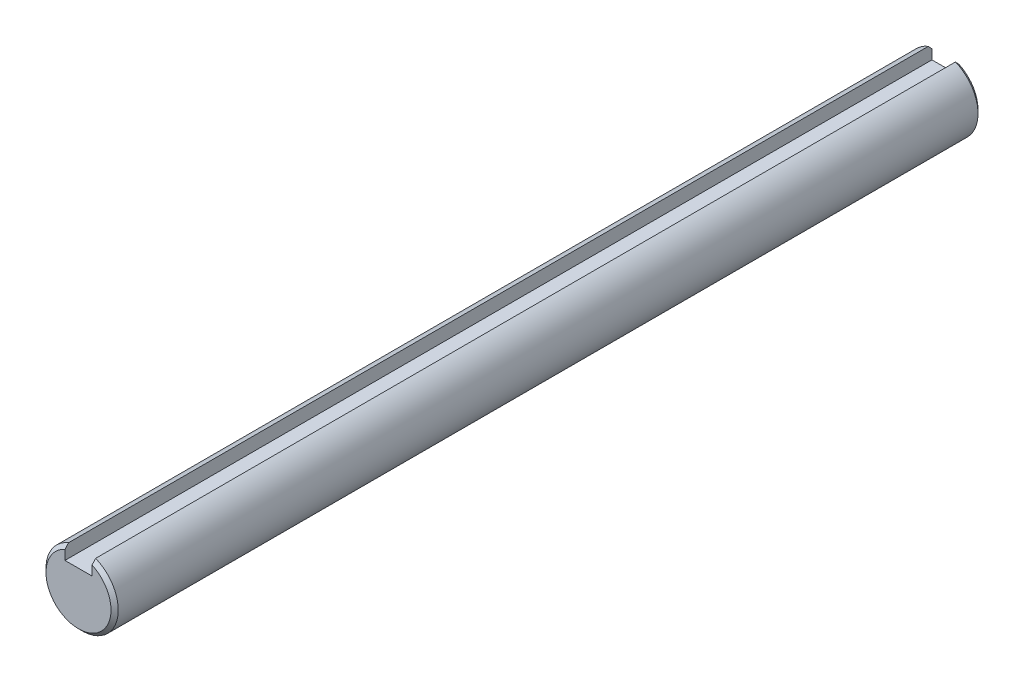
ISO-10303-21;
HEADER;
FILE_DESCRIPTION(('STEP AP214'),'2;1');
FILE_NAME('part.step','',(''),(''),'','','');
FILE_SCHEMA(('AUTOMOTIVE_DESIGN { 1 0 10303 214 1 1 1 1 }'));
ENDSEC;
DATA;
#1=APPLICATION_CONTEXT('core data for automotive mechanical design processes');
#2=APPLICATION_PROTOCOL_DEFINITION('international standard','automotive_design',2000,#1);
#3=PRODUCT_CONTEXT('',#1,'mechanical');
#4=PRODUCT('Part','Part','',(#3));
#5=PRODUCT_RELATED_PRODUCT_CATEGORY('part','',(#4));
#6=PRODUCT_DEFINITION_FORMATION('','',#4);
#7=PRODUCT_DEFINITION_CONTEXT('part definition',#1,'design');
#8=PRODUCT_DEFINITION('design','',#6,#7);
#9=PRODUCT_DEFINITION_SHAPE('','',#8);
#10=(LENGTH_UNIT() NAMED_UNIT(*) SI_UNIT(.MILLI.,.METRE.));
#11=(NAMED_UNIT(*) PLANE_ANGLE_UNIT() SI_UNIT($,.RADIAN.));
#12=(NAMED_UNIT(*) SI_UNIT($,.STERADIAN.) SOLID_ANGLE_UNIT());
#13=UNCERTAINTY_MEASURE_WITH_UNIT(LENGTH_MEASURE(1.E-05),#10,'distance_accuracy_value','');
#14=(GEOMETRIC_REPRESENTATION_CONTEXT(3) GLOBAL_UNCERTAINTY_ASSIGNED_CONTEXT((#13)) GLOBAL_UNIT_ASSIGNED_CONTEXT((#10,
#11,#12)) REPRESENTATION_CONTEXT('',''));
#15=CARTESIAN_POINT('',(0.,0.,0.));
#16=DIRECTION('',(0.,0.,1.));
#17=DIRECTION('',(1.,0.,0.));
#18=AXIS2_PLACEMENT_3D('',#15,#16,#17);
#19=CARTESIAN_POINT('',(0.,0.,38.1));
#20=DIRECTION('',(0.,0.,-1.));
#21=DIRECTION('',(-1.,0.,0.));
#22=AXIS2_PLACEMENT_3D('',#19,#20,#21);
#23=CYLINDRICAL_SURFACE('',#22,3.175);
#24=DIRECTION('',(0.,0.,-1.));
#25=VECTOR('',#24,1.);
#26=CARTESIAN_POINT('',(-1.190625,2.94330377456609,38.1));
#27=LINE('',#26,#25);
#28=CARTESIAN_POINT('',(-1.190625,2.94330377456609,37.7825));
#29=VERTEX_POINT('',#28);
#30=CARTESIAN_POINT('',(-1.190625,2.94330377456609,-37.7824999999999));
#31=VERTEX_POINT('',#30);
#32=EDGE_CURVE('E115',#29,#31,#27,.T.);
#33=ORIENTED_EDGE('',*,*,#32,.T.);
#34=CARTESIAN_POINT('',(0.,0.,-37.7824999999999));
#35=DIRECTION('',(0.,0.,1.));
#36=DIRECTION('',(1.,0.,0.));
#37=AXIS2_PLACEMENT_3D('',#34,#35,#36);
#38=CIRCLE('',#37,3.175);
#39=CARTESIAN_POINT('',(1.190625,2.94330377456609,-37.7824999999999));
#40=VERTEX_POINT('',#39);
#41=EDGE_CURVE('E126',#31,#40,#38,.T.);
#42=ORIENTED_EDGE('',*,*,#41,.T.);
#43=DIRECTION('',(0.,0.,-1.));
#44=VECTOR('',#43,1.);
#45=CARTESIAN_POINT('',(1.190625,2.94330377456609,38.1));
#46=LINE('',#45,#44);
#47=CARTESIAN_POINT('',(1.190625,2.94330377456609,37.7825));
#48=VERTEX_POINT('',#47);
#49=EDGE_CURVE('E119',#40,#48,#46,.F.);
#50=ORIENTED_EDGE('',*,*,#49,.T.);
#51=CARTESIAN_POINT('',(0.,0.,37.7825));
#52=DIRECTION('',(0.,0.,1.));
#53=DIRECTION('',(1.,0.,0.));
#54=AXIS2_PLACEMENT_3D('',#51,#52,#53);
#55=CIRCLE('',#54,3.175);
#56=EDGE_CURVE('E124',#48,#29,#55,.F.);
#57=ORIENTED_EDGE('',*,*,#56,.T.);
#58=EDGE_LOOP('',(#33,#42,#50,#57));
#59=FACE_BOUND('',#58,.T.);
#60=ADVANCED_FACE('F34',(#59),#23,.T.);
#61=CARTESIAN_POINT('',(0.,0.,38.1));
#62=DIRECTION('',(0.,0.,1.));
#63=DIRECTION('',(1.,0.,0.));
#64=AXIS2_PLACEMENT_3D('',#61,#62,#63);
#65=PLANE('',#64);
#66=DIRECTION('',(0.,-1.,0.));
#67=VECTOR('',#66,1.);
#68=CARTESIAN_POINT('',(-1.190625,3.175,38.1));
#69=LINE('',#68,#67);
#70=CARTESIAN_POINT('',(-1.190625,2.59763707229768,38.1));
#71=VERTEX_POINT('',#70);
#72=CARTESIAN_POINT('',(-1.190625,1.75267877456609,38.1));
#73=VERTEX_POINT('',#72);
#74=EDGE_CURVE('E88',#71,#73,#69,.T.);
#75=ORIENTED_EDGE('',*,*,#74,.F.);
#76=CARTESIAN_POINT('',(0.,0.,38.1));
#77=DIRECTION('',(0.,0.,1.));
#78=DIRECTION('',(1.,0.,0.));
#79=AXIS2_PLACEMENT_3D('',#76,#77,#78);
#80=CIRCLE('',#79,2.85750000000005);
#81=CARTESIAN_POINT('',(1.190625,2.59763707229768,38.1));
#82=VERTEX_POINT('',#81);
#83=EDGE_CURVE('E11',#71,#82,#80,.T.);
#84=ORIENTED_EDGE('',*,*,#83,.T.);
#85=DIRECTION('',(0.,1.,0.));
#86=VECTOR('',#85,1.);
#87=CARTESIAN_POINT('',(1.190625,3.175,38.1));
#88=LINE('',#87,#86);
#89=CARTESIAN_POINT('',(1.190625,1.75267877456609,38.1));
#90=VERTEX_POINT('',#89);
#91=EDGE_CURVE('E109',#90,#82,#88,.T.);
#92=ORIENTED_EDGE('',*,*,#91,.F.);
#93=DIRECTION('',(1.,0.,0.));
#94=VECTOR('',#93,1.);
#95=CARTESIAN_POINT('',(-1.190625,1.75267877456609,38.1));
#96=LINE('',#95,#94);
#97=EDGE_CURVE('E95',#73,#90,#96,.T.);
#98=ORIENTED_EDGE('',*,*,#97,.F.);
#99=EDGE_LOOP('',(#75,#84,#92,#98));
#100=FACE_BOUND('',#99,.T.);
#101=ADVANCED_FACE('F107',(#100),#65,.T.);
#102=CARTESIAN_POINT('',(0.,0.,-38.1));
#103=DIRECTION('',(0.,0.,1.));
#104=DIRECTION('',(1.,0.,0.));
#105=AXIS2_PLACEMENT_3D('',#102,#103,#104);
#106=PLANE('',#105);
#107=DIRECTION('',(0.,1.,0.));
#108=VECTOR('',#107,1.);
#109=CARTESIAN_POINT('',(1.190625,3.175,-38.1));
#110=LINE('',#109,#108);
#111=CARTESIAN_POINT('',(1.190625,1.75267877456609,-38.1));
#112=VERTEX_POINT('',#111);
#113=CARTESIAN_POINT('',(1.190625,2.59763707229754,-38.1));
#114=VERTEX_POINT('',#113);
#115=EDGE_CURVE('E105',#112,#114,#110,.T.);
#116=ORIENTED_EDGE('',*,*,#115,.T.);
#117=CARTESIAN_POINT('',(0.,0.,-38.1));
#118=DIRECTION('',(0.,0.,1.));
#119=DIRECTION('',(1.,0.,0.));
#120=AXIS2_PLACEMENT_3D('',#117,#118,#119);
#121=CIRCLE('',#120,2.85749999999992);
#122=CARTESIAN_POINT('',(-1.190625,2.59763707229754,-38.1));
#123=VERTEX_POINT('',#122);
#124=EDGE_CURVE('E58',#114,#123,#121,.F.);
#125=ORIENTED_EDGE('',*,*,#124,.T.);
#126=DIRECTION('',(0.,-1.,0.));
#127=VECTOR('',#126,1.);
#128=CARTESIAN_POINT('',(-1.190625,0.,-38.1));
#129=LINE('',#128,#127);
#130=CARTESIAN_POINT('',(-1.190625,1.75267877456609,-38.1));
#131=VERTEX_POINT('',#130);
#132=EDGE_CURVE('E122',#123,#131,#129,.T.);
#133=ORIENTED_EDGE('',*,*,#132,.T.);
#134=DIRECTION('',(1.,0.,0.));
#135=VECTOR('',#134,1.);
#136=CARTESIAN_POINT('',(-1.190625,1.75267877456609,-38.1));
#137=LINE('',#136,#135);
#138=EDGE_CURVE('E103',#131,#112,#137,.T.);
#139=ORIENTED_EDGE('',*,*,#138,.T.);
#140=EDGE_LOOP('',(#116,#125,#133,#139));
#141=FACE_BOUND('',#140,.T.);
#142=ADVANCED_FACE('F146',(#141),#106,.F.);
#143=CARTESIAN_POINT('',(1.190625,3.175,-38.1));
#144=DIRECTION('',(1.,0.,0.));
#145=DIRECTION('',(0.,0.,-1.));
#146=AXIS2_PLACEMENT_3D('',#143,#144,#145);
#147=PLANE('',#146);
#148=ORIENTED_EDGE('',*,*,#49,.F.);
#149=CARTESIAN_POINT('',(1.190625,2.94330377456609,-37.7824999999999));
#150=CARTESIAN_POINT('',(1.190625,2.88594978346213,-37.8356965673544));
#151=CARTESIAN_POINT('',(1.190625,2.82846723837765,-37.8887531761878));
#152=CARTESIAN_POINT('',(1.190625,2.7132450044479,-37.9945865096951));
#153=CARTESIAN_POINT('',(1.190625,2.65550531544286,-38.0473632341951));
#154=CARTESIAN_POINT('',(1.190625,2.59763707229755,-38.1));
#155=B_SPLINE_CURVE_WITH_KNOTS('',3,(#149,#150,#151,#152,#153,#154),.UNSPECIFIED.,.F.,.F.,(4,2,
4),(0.,0.234676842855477,0.469353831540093),.UNSPECIFIED.);
#156=EDGE_CURVE('E136',#40,#114,#155,.T.);
#157=ORIENTED_EDGE('',*,*,#156,.T.);
#158=ORIENTED_EDGE('',*,*,#115,.F.);
#159=DIRECTION('',(0.,0.,1.));
#160=VECTOR('',#159,1.);
#161=CARTESIAN_POINT('',(1.190625,1.75267877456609,-38.1));
#162=LINE('',#161,#160);
#163=EDGE_CURVE('E104',#112,#90,#162,.T.);
#164=ORIENTED_EDGE('',*,*,#163,.T.);
#165=ORIENTED_EDGE('',*,*,#91,.T.);
#166=CARTESIAN_POINT('',(1.190625,2.59763707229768,38.1));
#167=CARTESIAN_POINT('',(1.190625,2.65550531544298,38.0473632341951));
#168=CARTESIAN_POINT('',(1.190625,2.71324500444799,37.9945865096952));
#169=CARTESIAN_POINT('',(1.190625,2.82846723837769,37.8887531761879));
#170=CARTESIAN_POINT('',(1.190625,2.88594978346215,37.8356965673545));
#171=CARTESIAN_POINT('',(1.190625,2.94330377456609,37.7825));
#172=B_SPLINE_CURVE_WITH_KNOTS('',3,(#166,#167,#168,#169,#170,#171),.UNSPECIFIED.,.F.,.F.,(4,2,
4),(0.,0.234676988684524,0.469353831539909),.UNSPECIFIED.);
#173=EDGE_CURVE('E129',#82,#48,#172,.T.);
#174=ORIENTED_EDGE('',*,*,#173,.T.);
#175=EDGE_LOOP('',(#148,#157,#158,#164,#165,#174));
#176=FACE_BOUND('',#175,.T.);
#177=ADVANCED_FACE('F142',(#176),#147,.F.);
#178=CARTESIAN_POINT('',(-1.190625,3.175,-38.1));
#179=DIRECTION('',(-1.,0.,0.));
#180=DIRECTION('',(0.,-1.,0.));
#181=AXIS2_PLACEMENT_3D('',#178,#179,#180);
#182=PLANE('',#181);
#183=ORIENTED_EDGE('',*,*,#132,.F.);
#184=CARTESIAN_POINT('',(-1.190625,2.59763707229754,-38.1));
#185=CARTESIAN_POINT('',(-1.190625,2.65550531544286,-38.0473632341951));
#186=CARTESIAN_POINT('',(-1.190625,2.7132450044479,-37.9945865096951));
#187=CARTESIAN_POINT('',(-1.190625,2.82846723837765,-37.8887531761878));
#188=CARTESIAN_POINT('',(-1.190625,2.88594978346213,-37.8356965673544));
#189=CARTESIAN_POINT('',(-1.190625,2.94330377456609,-37.7824999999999));
#190=B_SPLINE_CURVE_WITH_KNOTS('',3,(#184,#185,#186,#187,#188,#189),.UNSPECIFIED.,.F.,.F.,(4,2,
4),(0.,0.234676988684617,0.469353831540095),.UNSPECIFIED.);
#191=EDGE_CURVE('E43',#123,#31,#190,.T.);
#192=ORIENTED_EDGE('',*,*,#191,.T.);
#193=ORIENTED_EDGE('',*,*,#32,.F.);
#194=CARTESIAN_POINT('',(-1.190625,2.94330377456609,37.7825));
#195=CARTESIAN_POINT('',(-1.190625,2.88594978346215,37.8356965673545));
#196=CARTESIAN_POINT('',(-1.190625,2.82846723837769,37.8887531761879));
#197=CARTESIAN_POINT('',(-1.190625,2.71324500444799,37.9945865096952));
#198=CARTESIAN_POINT('',(-1.190625,2.65550531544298,38.0473632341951));
#199=CARTESIAN_POINT('',(-1.190625,2.59763707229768,38.1));
#200=B_SPLINE_CURVE_WITH_KNOTS('',3,(#194,#195,#196,#197,#198,#199),.UNSPECIFIED.,.F.,.F.,(4,2,
4),(0.,0.234676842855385,0.469353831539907),.UNSPECIFIED.);
#201=EDGE_CURVE('E50',#29,#71,#200,.T.);
#202=ORIENTED_EDGE('',*,*,#201,.T.);
#203=ORIENTED_EDGE('',*,*,#74,.T.);
#204=DIRECTION('',(0.,0.,1.));
#205=VECTOR('',#204,1.);
#206=CARTESIAN_POINT('',(-1.190625,1.75267877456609,-38.1));
#207=LINE('',#206,#205);
#208=EDGE_CURVE('E91',#131,#73,#207,.T.);
#209=ORIENTED_EDGE('',*,*,#208,.F.);
#210=EDGE_LOOP('',(#183,#192,#193,#202,#203,#209));
#211=FACE_BOUND('',#210,.T.);
#212=ADVANCED_FACE('F90',(#211),#182,.F.);
#213=CARTESIAN_POINT('',(-1.190625,1.75267877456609,-38.1));
#214=DIRECTION('',(0.,-1.,0.));
#215=DIRECTION('',(0.,0.,-1.));
#216=AXIS2_PLACEMENT_3D('',#213,#214,#215);
#217=PLANE('',#216);
#218=ORIENTED_EDGE('',*,*,#163,.F.);
#219=ORIENTED_EDGE('',*,*,#138,.F.);
#220=ORIENTED_EDGE('',*,*,#208,.T.);
#221=ORIENTED_EDGE('',*,*,#97,.T.);
#222=EDGE_LOOP('',(#218,#219,#220,#221));
#223=FACE_BOUND('',#222,.T.);
#224=ADVANCED_FACE('F100',(#223),#217,.F.);
#225=CARTESIAN_POINT('',(0.,0.,-37.7824999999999));
#226=DIRECTION('',(0.,0.,1.));
#227=DIRECTION('',(1.,0.,0.));
#228=AXIS2_PLACEMENT_3D('',#225,#226,#227);
#229=CONICAL_SURFACE('',#228,3.175,0.785398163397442);
#230=ORIENTED_EDGE('',*,*,#191,.F.);
#231=ORIENTED_EDGE('',*,*,#124,.F.);
#232=ORIENTED_EDGE('',*,*,#156,.F.);
#233=ORIENTED_EDGE('',*,*,#41,.F.);
#234=EDGE_LOOP('',(#230,#231,#232,#233));
#235=FACE_BOUND('',#234,.T.);
#236=ADVANCED_FACE('F151',(#235),#229,.T.);
#237=CARTESIAN_POINT('',(0.,0.,38.1));
#238=DIRECTION('',(0.,0.,-1.));
#239=DIRECTION('',(-1.,0.,0.));
#240=AXIS2_PLACEMENT_3D('',#237,#238,#239);
#241=CONICAL_SURFACE('',#240,2.85750000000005,0.785398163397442);
#242=ORIENTED_EDGE('',*,*,#201,.F.);
#243=ORIENTED_EDGE('',*,*,#56,.F.);
#244=ORIENTED_EDGE('',*,*,#173,.F.);
#245=ORIENTED_EDGE('',*,*,#83,.F.);
#246=EDGE_LOOP('',(#242,#243,#244,#245));
#247=FACE_BOUND('',#246,.T.);
#248=ADVANCED_FACE('F36',(#247),#241,.T.);
#249=CLOSED_SHELL('',(#60,#101,#142,#177,#212,#224,#236,#248));
#250=MANIFOLD_SOLID_BREP('B2',#249);
#251=ADVANCED_BREP_SHAPE_REPRESENTATION('',(#18,#250),#14);
#252=SHAPE_DEFINITION_REPRESENTATION(#9,#251);
ENDSEC;
END-ISO-10303-21;
